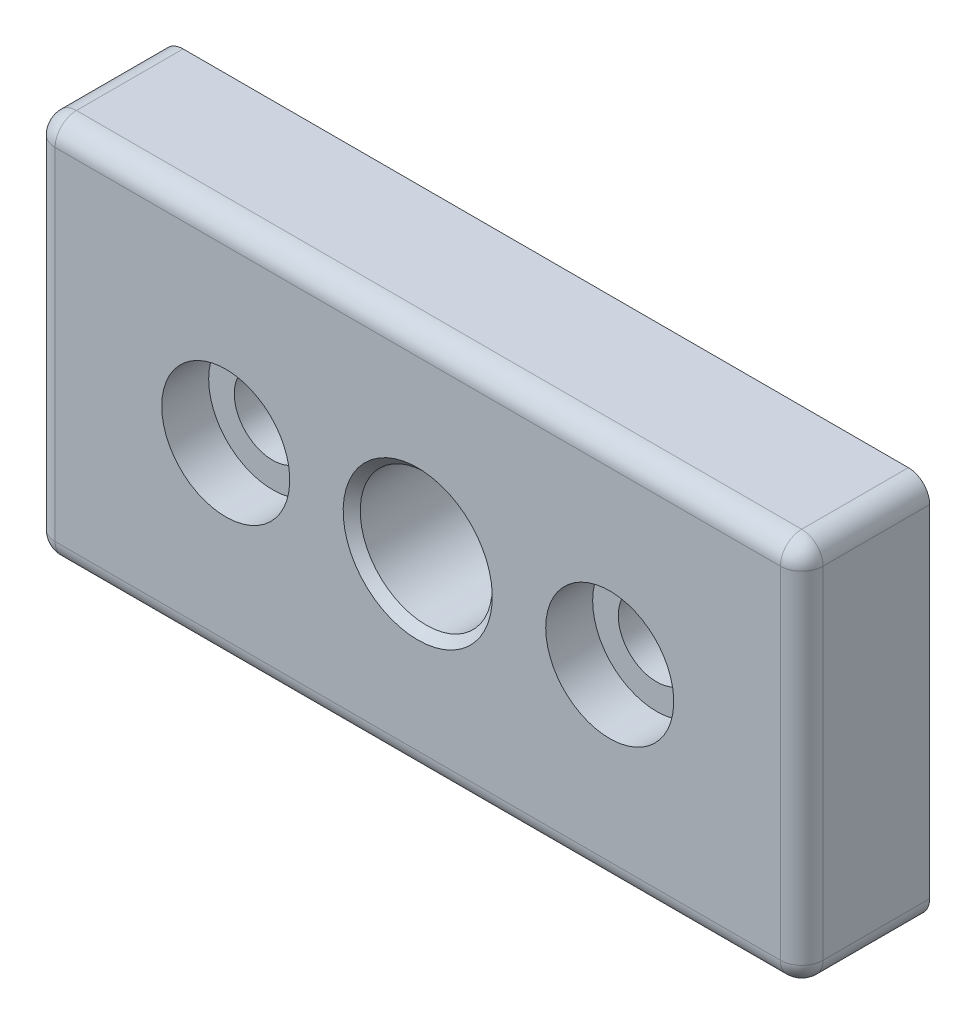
ISO-10303-21;
HEADER;
FILE_DESCRIPTION(('STEP AP214'),'2;1');
FILE_NAME('part.step','',(''),(''),'','','');
FILE_SCHEMA(('AUTOMOTIVE_DESIGN { 1 0 10303 214 1 1 1 1 }'));
ENDSEC;
DATA;
#1=APPLICATION_CONTEXT('core data for automotive mechanical design processes');
#2=APPLICATION_PROTOCOL_DEFINITION('international standard','automotive_design',2000,#1);
#3=PRODUCT_CONTEXT('',#1,'mechanical');
#4=PRODUCT('Part','Part','',(#3));
#5=PRODUCT_RELATED_PRODUCT_CATEGORY('part','',(#4));
#6=PRODUCT_DEFINITION_FORMATION('','',#4);
#7=PRODUCT_DEFINITION_CONTEXT('part definition',#1,'design');
#8=PRODUCT_DEFINITION('design','',#6,#7);
#9=PRODUCT_DEFINITION_SHAPE('','',#8);
#10=(LENGTH_UNIT() NAMED_UNIT(*) SI_UNIT(.MILLI.,.METRE.));
#11=(NAMED_UNIT(*) PLANE_ANGLE_UNIT() SI_UNIT($,.RADIAN.));
#12=(NAMED_UNIT(*) SI_UNIT($,.STERADIAN.) SOLID_ANGLE_UNIT());
#13=UNCERTAINTY_MEASURE_WITH_UNIT(LENGTH_MEASURE(1.E-05),#10,'distance_accuracy_value','');
#14=(GEOMETRIC_REPRESENTATION_CONTEXT(3) GLOBAL_UNCERTAINTY_ASSIGNED_CONTEXT((#13)) GLOBAL_UNIT_ASSIGNED_CONTEXT((#10,
#11,#12)) REPRESENTATION_CONTEXT('',''));
#15=CARTESIAN_POINT('',(0.,0.,0.));
#16=DIRECTION('',(0.,0.,1.));
#17=DIRECTION('',(1.,0.,0.));
#18=AXIS2_PLACEMENT_3D('',#15,#16,#17);
#19=CARTESIAN_POINT('',(0.,0.,15.0000000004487));
#20=DIRECTION('',(0.,0.,1.));
#21=DIRECTION('',(0.,-1.,0.));
#22=AXIS2_PLACEMENT_3D('',#19,#20,#21);
#23=CONICAL_SURFACE('',#22,8.73906249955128,0.7853981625);
#24=CARTESIAN_POINT('',(0.,0.,15.0000000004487));
#25=DIRECTION('',(0.,0.,1.));
#26=DIRECTION('',(0.,-1.,0.));
#27=AXIS2_PLACEMENT_3D('',#24,#25,#26);
#28=CIRCLE('',#27,8.73906249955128);
#29=CARTESIAN_POINT('',(0.,-8.73906249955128,15.0000000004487));
#30=VERTEX_POINT('',#29);
#31=EDGE_CURVE('E19',#30,#30,#28,.F.);
#32=ORIENTED_EDGE('',*,*,#31,.F.);
#33=EDGE_LOOP('',(#32));
#34=FACE_BOUND('',#33,.T.);
#35=CARTESIAN_POINT('',(0.,0.,14.));
#36=DIRECTION('',(0.,0.,1.));
#37=DIRECTION('',(1.,0.,0.));
#38=AXIS2_PLACEMENT_3D('',#35,#36,#37);
#39=CIRCLE('',#38,7.7390625);
#40=CARTESIAN_POINT('',(7.7390625,0.,14.));
#41=VERTEX_POINT('',#40);
#42=EDGE_CURVE('E118',#41,#41,#39,.F.);
#43=ORIENTED_EDGE('',*,*,#42,.T.);
#44=EDGE_LOOP('',(#43));
#45=FACE_BOUND('',#44,.T.);
#46=ADVANCED_FACE('F15',(#34,#45),#23,.F.);
#47=CARTESIAN_POINT('',(0.,0.,15.));
#48=DIRECTION('',(0.,0.,1.));
#49=DIRECTION('',(1.,0.,0.));
#50=AXIS2_PLACEMENT_3D('',#47,#48,#49);
#51=PLANE('',#50);
#52=ORIENTED_EDGE('',*,*,#31,.T.);
#53=EDGE_LOOP('',(#52));
#54=FACE_BOUND('',#53,.T.);
#55=CARTESIAN_POINT('',(-22.5,0.,15.));
#56=DIRECTION('',(0.,0.,-1.));
#57=DIRECTION('',(-1.,0.,0.));
#58=AXIS2_PLACEMENT_3D('',#55,#56,#57);
#59=CIRCLE('',#58,7.5);
#60=CARTESIAN_POINT('',(-30.,0.,15.));
#61=VERTEX_POINT('',#60);
#62=EDGE_CURVE('E116',#61,#61,#59,.T.);
#63=ORIENTED_EDGE('',*,*,#62,.T.);
#64=EDGE_LOOP('',(#63));
#65=FACE_BOUND('',#64,.T.);
#66=CARTESIAN_POINT('',(22.5,0.,15.));
#67=DIRECTION('',(0.,0.,-1.));
#68=DIRECTION('',(-1.,0.,0.));
#69=AXIS2_PLACEMENT_3D('',#66,#67,#68);
#70=CIRCLE('',#69,7.5);
#71=CARTESIAN_POINT('',(15.,0.,15.));
#72=VERTEX_POINT('',#71);
#73=EDGE_CURVE('E113',#72,#72,#70,.T.);
#74=ORIENTED_EDGE('',*,*,#73,.T.);
#75=EDGE_LOOP('',(#74));
#76=FACE_BOUND('',#75,.T.);
#77=DIRECTION('',(-1.,0.,0.));
#78=VECTOR('',#77,1.);
#79=CARTESIAN_POINT('',(22.5,-20.,15.));
#80=LINE('',#79,#78);
#81=CARTESIAN_POINT('',(42.5,-20.0000000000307,15.));
#82=VERTEX_POINT('',#81);
#83=CARTESIAN_POINT('',(-42.5,-20.,15.));
#84=VERTEX_POINT('',#83);
#85=EDGE_CURVE('E139',#82,#84,#80,.T.);
#86=ORIENTED_EDGE('',*,*,#85,.F.);
#87=DIRECTION('',(0.,-1.,0.));
#88=VECTOR('',#87,1.);
#89=CARTESIAN_POINT('',(42.5,11.25,15.));
#90=LINE('',#89,#88);
#91=CARTESIAN_POINT('',(42.5,20.,15.));
#92=VERTEX_POINT('',#91);
#93=EDGE_CURVE('E132',#92,#82,#90,.T.);
#94=ORIENTED_EDGE('',*,*,#93,.F.);
#95=DIRECTION('',(1.,0.,0.));
#96=VECTOR('',#95,1.);
#97=CARTESIAN_POINT('',(-22.5,20.,15.));
#98=LINE('',#97,#96);
#99=CARTESIAN_POINT('',(-42.5,20.0000000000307,15.));
#100=VERTEX_POINT('',#99);
#101=EDGE_CURVE('E115',#100,#92,#98,.T.);
#102=ORIENTED_EDGE('',*,*,#101,.F.);
#103=DIRECTION('',(0.,1.,0.));
#104=VECTOR('',#103,1.);
#105=CARTESIAN_POINT('',(-42.5,-11.25,15.));
#106=LINE('',#105,#104);
#107=EDGE_CURVE('E144',#84,#100,#106,.T.);
#108=ORIENTED_EDGE('',*,*,#107,.F.);
#109=EDGE_LOOP('',(#86,#94,#102,#108));
#110=FACE_BOUND('',#109,.T.);
#111=ADVANCED_FACE('F280',(#54,#65,#76,#110),#51,.T.);
#112=CARTESIAN_POINT('',(0.,0.,0.));
#113=DIRECTION('',(0.,0.,1.));
#114=DIRECTION('',(1.,0.,0.));
#115=AXIS2_PLACEMENT_3D('',#112,#113,#114);
#116=CYLINDRICAL_SURFACE('',#115,7.7390625);
#117=ORIENTED_EDGE('',*,*,#42,.F.);
#118=EDGE_LOOP('',(#117));
#119=FACE_BOUND('',#118,.T.);
#120=CARTESIAN_POINT('',(0.,0.,0.));
#121=DIRECTION('',(0.,0.,1.));
#122=DIRECTION('',(1.,0.,0.));
#123=AXIS2_PLACEMENT_3D('',#120,#121,#122);
#124=CIRCLE('',#123,7.7390625);
#125=CARTESIAN_POINT('',(7.7390625,0.,0.));
#126=VERTEX_POINT('',#125);
#127=EDGE_CURVE('E109',#126,#126,#124,.F.);
#128=ORIENTED_EDGE('',*,*,#127,.T.);
#129=EDGE_LOOP('',(#128));
#130=FACE_BOUND('',#129,.T.);
#131=ADVANCED_FACE('F276',(#119,#130),#116,.F.);
#132=CARTESIAN_POINT('',(-22.5,0.,15.));
#133=DIRECTION('',(0.,0.,-1.));
#134=DIRECTION('',(-1.,0.,0.));
#135=AXIS2_PLACEMENT_3D('',#132,#133,#134);
#136=CYLINDRICAL_SURFACE('',#135,7.5);
#137=CARTESIAN_POINT('',(-22.5,0.,9.5));
#138=DIRECTION('',(0.,0.,-1.));
#139=DIRECTION('',(-1.,0.,0.));
#140=AXIS2_PLACEMENT_3D('',#137,#138,#139);
#141=CIRCLE('',#140,7.5);
#142=CARTESIAN_POINT('',(-30.,0.,9.5));
#143=VERTEX_POINT('',#142);
#144=EDGE_CURVE('E106',#143,#143,#141,.T.);
#145=ORIENTED_EDGE('',*,*,#144,.T.);
#146=EDGE_LOOP('',(#145));
#147=FACE_BOUND('',#146,.T.);
#148=ORIENTED_EDGE('',*,*,#62,.F.);
#149=EDGE_LOOP('',(#148));
#150=FACE_BOUND('',#149,.T.);
#151=ADVANCED_FACE('F279',(#147,#150),#136,.F.);
#152=CARTESIAN_POINT('',(22.5,0.,15.));
#153=DIRECTION('',(0.,0.,-1.));
#154=DIRECTION('',(-1.,0.,0.));
#155=AXIS2_PLACEMENT_3D('',#152,#153,#154);
#156=CYLINDRICAL_SURFACE('',#155,7.5);
#157=CARTESIAN_POINT('',(22.5,0.,9.5));
#158=DIRECTION('',(0.,0.,-1.));
#159=DIRECTION('',(-1.,0.,0.));
#160=AXIS2_PLACEMENT_3D('',#157,#158,#159);
#161=CIRCLE('',#160,7.5);
#162=CARTESIAN_POINT('',(15.,0.,9.5));
#163=VERTEX_POINT('',#162);
#164=EDGE_CURVE('E102',#163,#163,#161,.T.);
#165=ORIENTED_EDGE('',*,*,#164,.T.);
#166=EDGE_LOOP('',(#165));
#167=FACE_BOUND('',#166,.T.);
#168=ORIENTED_EDGE('',*,*,#73,.F.);
#169=EDGE_LOOP('',(#168));
#170=FACE_BOUND('',#169,.T.);
#171=ADVANCED_FACE('F274',(#167,#170),#156,.F.);
#172=CARTESIAN_POINT('',(-22.5,20.,12.5));
#173=DIRECTION('',(1.,0.,0.));
#174=DIRECTION('',(0.,1.,0.));
#175=AXIS2_PLACEMENT_3D('',#172,#173,#174);
#176=CYLINDRICAL_SURFACE('',#175,2.5);
#177=CARTESIAN_POINT('',(-42.5,20.,12.5));
#178=DIRECTION('',(1.,0.,0.));
#179=DIRECTION('',(0.,1.,0.));
#180=AXIS2_PLACEMENT_3D('',#177,#178,#179);
#181=CIRCLE('',#180,2.5);
#182=CARTESIAN_POINT('',(-42.5,22.5,12.5));
#183=VERTEX_POINT('',#182);
#184=EDGE_CURVE('E128',#100,#183,#181,.F.);
#185=ORIENTED_EDGE('',*,*,#184,.F.);
#186=ORIENTED_EDGE('',*,*,#101,.T.);
#187=CARTESIAN_POINT('',(42.5,20.,12.5));
#188=DIRECTION('',(1.,0.,0.));
#189=DIRECTION('',(0.,1.,0.));
#190=AXIS2_PLACEMENT_3D('',#187,#188,#189);
#191=CIRCLE('',#190,2.5);
#192=CARTESIAN_POINT('',(42.5,22.5,12.5));
#193=VERTEX_POINT('',#192);
#194=EDGE_CURVE('E135',#193,#92,#191,.T.);
#195=ORIENTED_EDGE('',*,*,#194,.F.);
#196=DIRECTION('',(1.,0.,0.));
#197=VECTOR('',#196,1.);
#198=CARTESIAN_POINT('',(-45.,22.5,12.5));
#199=LINE('',#198,#197);
#200=EDGE_CURVE('E105',#183,#193,#199,.T.);
#201=ORIENTED_EDGE('',*,*,#200,.F.);
#202=EDGE_LOOP('',(#185,#186,#195,#201));
#203=FACE_BOUND('',#202,.T.);
#204=ADVANCED_FACE('F270',(#203),#176,.T.);
#205=CARTESIAN_POINT('',(-42.5,20.,12.5));
#206=DIRECTION('',(1.,0.,0.));
#207=DIRECTION('',(0.,1.,0.));
#208=AXIS2_PLACEMENT_3D('',#205,#206,#207);
#209=SPHERICAL_SURFACE('',#208,2.5);
#210=ORIENTED_EDGE('',*,*,#184,.T.);
#211=CARTESIAN_POINT('',(-42.5,20.,12.5));
#212=DIRECTION('',(0.,0.,1.));
#213=DIRECTION('',(1.,0.,0.));
#214=AXIS2_PLACEMENT_3D('',#211,#212,#213);
#215=CIRCLE('',#214,2.5);
#216=CARTESIAN_POINT('',(-45.,20.,12.5));
#217=VERTEX_POINT('',#216);
#218=EDGE_CURVE('E228',#217,#183,#215,.F.);
#219=ORIENTED_EDGE('',*,*,#218,.F.);
#220=CARTESIAN_POINT('',(-42.5,20.,12.5));
#221=DIRECTION('',(0.,1.,0.));
#222=DIRECTION('',(-1.,0.,0.));
#223=AXIS2_PLACEMENT_3D('',#220,#221,#222);
#224=CIRCLE('',#223,2.5);
#225=EDGE_CURVE('E147',#100,#217,#224,.F.);
#226=ORIENTED_EDGE('',*,*,#225,.F.);
#227=EDGE_LOOP('',(#210,#219,#226));
#228=FACE_BOUND('',#227,.T.);
#229=ADVANCED_FACE('F267',(#228),#209,.T.);
#230=CARTESIAN_POINT('',(-42.5,-11.25,12.5));
#231=DIRECTION('',(0.,1.,0.));
#232=DIRECTION('',(-1.,0.,0.));
#233=AXIS2_PLACEMENT_3D('',#230,#231,#232);
#234=CYLINDRICAL_SURFACE('',#233,2.5);
#235=CARTESIAN_POINT('',(-42.5,-20.,12.5));
#236=DIRECTION('',(0.,-1.,0.));
#237=DIRECTION('',(1.,0.,0.));
#238=AXIS2_PLACEMENT_3D('',#235,#236,#237);
#239=CIRCLE('',#238,2.5);
#240=CARTESIAN_POINT('',(-45.,-20.,12.5));
#241=VERTEX_POINT('',#240);
#242=EDGE_CURVE('E146',#84,#241,#239,.T.);
#243=ORIENTED_EDGE('',*,*,#242,.F.);
#244=ORIENTED_EDGE('',*,*,#107,.T.);
#245=ORIENTED_EDGE('',*,*,#225,.T.);
#246=DIRECTION('',(0.,1.,0.));
#247=VECTOR('',#246,1.);
#248=CARTESIAN_POINT('',(-45.,-22.5,12.5));
#249=LINE('',#248,#247);
#250=EDGE_CURVE('E74',#241,#217,#249,.T.);
#251=ORIENTED_EDGE('',*,*,#250,.F.);
#252=EDGE_LOOP('',(#243,#244,#245,#251));
#253=FACE_BOUND('',#252,.T.);
#254=ADVANCED_FACE('F255',(#253),#234,.T.);
#255=CARTESIAN_POINT('',(-42.5,-20.,12.5));
#256=DIRECTION('',(1.,0.,0.));
#257=DIRECTION('',(0.,1.,0.));
#258=AXIS2_PLACEMENT_3D('',#255,#256,#257);
#259=SPHERICAL_SURFACE('',#258,2.5);
#260=ORIENTED_EDGE('',*,*,#242,.T.);
#261=CARTESIAN_POINT('',(-42.5,-20.,12.5));
#262=DIRECTION('',(0.,0.,1.));
#263=DIRECTION('',(1.,0.,0.));
#264=AXIS2_PLACEMENT_3D('',#261,#262,#263);
#265=CIRCLE('',#264,2.5);
#266=CARTESIAN_POINT('',(-42.5,-22.5,12.5));
#267=VERTEX_POINT('',#266);
#268=EDGE_CURVE('E456',#267,#241,#265,.F.);
#269=ORIENTED_EDGE('',*,*,#268,.F.);
#270=CARTESIAN_POINT('',(-42.5,-20.,12.5));
#271=DIRECTION('',(-1.,0.,0.));
#272=DIRECTION('',(0.,0.,1.));
#273=AXIS2_PLACEMENT_3D('',#270,#271,#272);
#274=CIRCLE('',#273,2.5);
#275=EDGE_CURVE('E143',#84,#267,#274,.F.);
#276=ORIENTED_EDGE('',*,*,#275,.F.);
#277=EDGE_LOOP('',(#260,#269,#276));
#278=FACE_BOUND('',#277,.T.);
#279=ADVANCED_FACE('F250',(#278),#259,.T.);
#280=CARTESIAN_POINT('',(22.5,-20.,12.5));
#281=DIRECTION('',(-1.,0.,0.));
#282=DIRECTION('',(0.,0.,1.));
#283=AXIS2_PLACEMENT_3D('',#280,#281,#282);
#284=CYLINDRICAL_SURFACE('',#283,2.5);
#285=CARTESIAN_POINT('',(42.5,-20.,12.5));
#286=DIRECTION('',(1.,0.,0.));
#287=DIRECTION('',(0.,1.,0.));
#288=AXIS2_PLACEMENT_3D('',#285,#286,#287);
#289=CIRCLE('',#288,2.5);
#290=CARTESIAN_POINT('',(42.5,-22.5,12.5));
#291=VERTEX_POINT('',#290);
#292=EDGE_CURVE('E142',#82,#291,#289,.T.);
#293=ORIENTED_EDGE('',*,*,#292,.F.);
#294=ORIENTED_EDGE('',*,*,#85,.T.);
#295=ORIENTED_EDGE('',*,*,#275,.T.);
#296=DIRECTION('',(1.,0.,0.));
#297=VECTOR('',#296,1.);
#298=CARTESIAN_POINT('',(45.,-22.5,12.5));
#299=LINE('',#298,#297);
#300=EDGE_CURVE('E236',#291,#267,#299,.F.);
#301=ORIENTED_EDGE('',*,*,#300,.F.);
#302=EDGE_LOOP('',(#293,#294,#295,#301));
#303=FACE_BOUND('',#302,.T.);
#304=ADVANCED_FACE('F246',(#303),#284,.T.);
#305=CARTESIAN_POINT('',(42.5,-20.,12.5));
#306=DIRECTION('',(1.,0.,0.));
#307=DIRECTION('',(0.,1.,0.));
#308=AXIS2_PLACEMENT_3D('',#305,#306,#307);
#309=SPHERICAL_SURFACE('',#308,2.5);
#310=CARTESIAN_POINT('',(42.5,-20.,12.5));
#311=DIRECTION('',(0.,-1.,0.));
#312=DIRECTION('',(1.,0.,0.));
#313=AXIS2_PLACEMENT_3D('',#310,#311,#312);
#314=CIRCLE('',#313,2.5);
#315=CARTESIAN_POINT('',(45.,-20.,12.5));
#316=VERTEX_POINT('',#315);
#317=EDGE_CURVE('E136',#82,#316,#314,.F.);
#318=ORIENTED_EDGE('',*,*,#317,.F.);
#319=ORIENTED_EDGE('',*,*,#292,.T.);
#320=CARTESIAN_POINT('',(42.5,-20.,12.5));
#321=DIRECTION('',(0.,0.,1.));
#322=DIRECTION('',(1.,0.,0.));
#323=AXIS2_PLACEMENT_3D('',#320,#321,#322);
#324=CIRCLE('',#323,2.5);
#325=EDGE_CURVE('E229',#316,#291,#324,.F.);
#326=ORIENTED_EDGE('',*,*,#325,.F.);
#327=EDGE_LOOP('',(#318,#319,#326));
#328=FACE_BOUND('',#327,.T.);
#329=ADVANCED_FACE('F243',(#328),#309,.T.);
#330=CARTESIAN_POINT('',(42.5,11.25,12.5));
#331=DIRECTION('',(0.,-1.,0.));
#332=DIRECTION('',(1.,0.,0.));
#333=AXIS2_PLACEMENT_3D('',#330,#331,#332);
#334=CYLINDRICAL_SURFACE('',#333,2.5);
#335=CARTESIAN_POINT('',(42.5,20.,12.5));
#336=DIRECTION('',(0.,-1.,0.));
#337=DIRECTION('',(1.,0.,0.));
#338=AXIS2_PLACEMENT_3D('',#335,#336,#337);
#339=CIRCLE('',#338,2.5);
#340=CARTESIAN_POINT('',(45.,20.,12.5));
#341=VERTEX_POINT('',#340);
#342=EDGE_CURVE('E112',#92,#341,#339,.F.);
#343=ORIENTED_EDGE('',*,*,#342,.F.);
#344=ORIENTED_EDGE('',*,*,#93,.T.);
#345=ORIENTED_EDGE('',*,*,#317,.T.);
#346=DIRECTION('',(0.,1.,0.));
#347=VECTOR('',#346,1.);
#348=CARTESIAN_POINT('',(45.,22.5,12.5));
#349=LINE('',#348,#347);
#350=EDGE_CURVE('E462',#341,#316,#349,.F.);
#351=ORIENTED_EDGE('',*,*,#350,.F.);
#352=EDGE_LOOP('',(#343,#344,#345,#351));
#353=FACE_BOUND('',#352,.T.);
#354=ADVANCED_FACE('F214',(#353),#334,.T.);
#355=CARTESIAN_POINT('',(42.5,20.,12.5));
#356=DIRECTION('',(1.,0.,0.));
#357=DIRECTION('',(0.,1.,0.));
#358=AXIS2_PLACEMENT_3D('',#355,#356,#357);
#359=SPHERICAL_SURFACE('',#358,2.5);
#360=ORIENTED_EDGE('',*,*,#194,.T.);
#361=ORIENTED_EDGE('',*,*,#342,.T.);
#362=CARTESIAN_POINT('',(42.5,20.,12.5));
#363=DIRECTION('',(0.,0.,1.));
#364=DIRECTION('',(1.,0.,0.));
#365=AXIS2_PLACEMENT_3D('',#362,#363,#364);
#366=CIRCLE('',#365,2.5);
#367=EDGE_CURVE('E220',#193,#341,#366,.F.);
#368=ORIENTED_EDGE('',*,*,#367,.F.);
#369=EDGE_LOOP('',(#360,#361,#368));
#370=FACE_BOUND('',#369,.T.);
#371=ADVANCED_FACE('F209',(#370),#359,.T.);
#372=CARTESIAN_POINT('',(0.,0.,0.));
#373=DIRECTION('',(0.,0.,1.));
#374=DIRECTION('',(1.,0.,0.));
#375=AXIS2_PLACEMENT_3D('',#372,#373,#374);
#376=PLANE('',#375);
#377=ORIENTED_EDGE('',*,*,#127,.F.);
#378=EDGE_LOOP('',(#377));
#379=FACE_BOUND('',#378,.T.);
#380=CARTESIAN_POINT('',(0.,0.,0.));
#381=DIRECTION('',(0.,0.,-1.));
#382=DIRECTION('',(-1.,0.,0.));
#383=AXIS2_PLACEMENT_3D('',#380,#381,#382);
#384=CIRCLE('',#383,8.3);
#385=CARTESIAN_POINT('',(-8.3,0.,0.));
#386=VERTEX_POINT('',#385);
#387=EDGE_CURVE('E99',#386,#386,#384,.T.);
#388=ORIENTED_EDGE('',*,*,#387,.T.);
#389=EDGE_LOOP('',(#388));
#390=FACE_BOUND('',#389,.T.);
#391=ADVANCED_FACE('F205',(#379,#390),#376,.F.);
#392=CARTESIAN_POINT('',(-30.15,7.65,9.5));
#393=DIRECTION('',(0.,0.,-1.));
#394=DIRECTION('',(1.,0.,0.));
#395=AXIS2_PLACEMENT_3D('',#392,#393,#394);
#396=PLANE('',#395);
#397=CARTESIAN_POINT('',(-22.5,0.,9.5));
#398=DIRECTION('',(0.,0.,1.));
#399=DIRECTION('',(1.,0.,0.));
#400=AXIS2_PLACEMENT_3D('',#397,#398,#399);
#401=CIRCLE('',#400,4.5);
#402=CARTESIAN_POINT('',(-18.,0.,9.5));
#403=VERTEX_POINT('',#402);
#404=EDGE_CURVE('E96',#403,#403,#401,.F.);
#405=ORIENTED_EDGE('',*,*,#404,.T.);
#406=EDGE_LOOP('',(#405));
#407=FACE_BOUND('',#406,.T.);
#408=ORIENTED_EDGE('',*,*,#144,.F.);
#409=EDGE_LOOP('',(#408));
#410=FACE_BOUND('',#409,.T.);
#411=ADVANCED_FACE('F208',(#407,#410),#396,.F.);
#412=CARTESIAN_POINT('',(14.85,7.65,9.5));
#413=DIRECTION('',(0.,0.,-1.));
#414=DIRECTION('',(1.,0.,0.));
#415=AXIS2_PLACEMENT_3D('',#412,#413,#414);
#416=PLANE('',#415);
#417=CARTESIAN_POINT('',(22.5,0.,9.5));
#418=DIRECTION('',(0.,0.,1.));
#419=DIRECTION('',(1.,0.,0.));
#420=AXIS2_PLACEMENT_3D('',#417,#418,#419);
#421=CIRCLE('',#420,4.5);
#422=CARTESIAN_POINT('',(27.,0.,9.5));
#423=VERTEX_POINT('',#422);
#424=EDGE_CURVE('E89',#423,#423,#421,.F.);
#425=ORIENTED_EDGE('',*,*,#424,.T.);
#426=EDGE_LOOP('',(#425));
#427=FACE_BOUND('',#426,.T.);
#428=ORIENTED_EDGE('',*,*,#164,.F.);
#429=EDGE_LOOP('',(#428));
#430=FACE_BOUND('',#429,.T.);
#431=ADVANCED_FACE('F17',(#427,#430),#416,.F.);
#432=CARTESIAN_POINT('',(-45.,22.5,0.));
#433=DIRECTION('',(0.,1.,0.));
#434=DIRECTION('',(0.,0.,1.));
#435=AXIS2_PLACEMENT_3D('',#432,#433,#434);
#436=PLANE('',#435);
#437=DIRECTION('',(0.,0.,1.));
#438=VECTOR('',#437,1.);
#439=CARTESIAN_POINT('',(-42.5,22.5,0.));
#440=LINE('',#439,#438);
#441=CARTESIAN_POINT('',(-42.5,22.5,0.));
#442=VERTEX_POINT('',#441);
#443=EDGE_CURVE('E60',#183,#442,#440,.F.);
#444=ORIENTED_EDGE('',*,*,#443,.F.);
#445=ORIENTED_EDGE('',*,*,#200,.T.);
#446=DIRECTION('',(0.,0.,1.));
#447=VECTOR('',#446,1.);
#448=CARTESIAN_POINT('',(42.5,22.5,0.));
#449=LINE('',#448,#447);
#450=CARTESIAN_POINT('',(42.5,22.5,0.));
#451=VERTEX_POINT('',#450);
#452=EDGE_CURVE('E468',#451,#193,#449,.T.);
#453=ORIENTED_EDGE('',*,*,#452,.F.);
#454=DIRECTION('',(1.,0.,0.));
#455=VECTOR('',#454,1.);
#456=CARTESIAN_POINT('',(0.,22.5,0.));
#457=LINE('',#456,#455);
#458=EDGE_CURVE('E87',#451,#442,#457,.F.);
#459=ORIENTED_EDGE('',*,*,#458,.T.);
#460=EDGE_LOOP('',(#444,#445,#453,#459));
#461=FACE_BOUND('',#460,.T.);
#462=ADVANCED_FACE('F201',(#461),#436,.T.);
#463=CARTESIAN_POINT('',(-42.5,20.,0.));
#464=DIRECTION('',(0.,0.,1.));
#465=DIRECTION('',(1.,0.,0.));
#466=AXIS2_PLACEMENT_3D('',#463,#464,#465);
#467=CYLINDRICAL_SURFACE('',#466,2.5);
#468=ORIENTED_EDGE('',*,*,#218,.T.);
#469=ORIENTED_EDGE('',*,*,#443,.T.);
#470=CARTESIAN_POINT('',(-42.5,20.,0.));
#471=DIRECTION('',(0.,0.,1.));
#472=DIRECTION('',(1.,0.,0.));
#473=AXIS2_PLACEMENT_3D('',#470,#471,#472);
#474=CIRCLE('',#473,2.5);
#475=CARTESIAN_POINT('',(-45.,20.,0.));
#476=VERTEX_POINT('',#475);
#477=EDGE_CURVE('E80',#442,#476,#474,.T.);
#478=ORIENTED_EDGE('',*,*,#477,.T.);
#479=DIRECTION('',(0.,0.,1.));
#480=VECTOR('',#479,1.);
#481=CARTESIAN_POINT('',(-45.,20.,0.));
#482=LINE('',#481,#480);
#483=EDGE_CURVE('E67',#217,#476,#482,.F.);
#484=ORIENTED_EDGE('',*,*,#483,.F.);
#485=EDGE_LOOP('',(#468,#469,#478,#484));
#486=FACE_BOUND('',#485,.T.);
#487=ADVANCED_FACE('F86',(#486),#467,.T.);
#488=CARTESIAN_POINT('',(-45.,-22.5,0.));
#489=DIRECTION('',(-1.,0.,0.));
#490=DIRECTION('',(0.,0.,1.));
#491=AXIS2_PLACEMENT_3D('',#488,#489,#490);
#492=PLANE('',#491);
#493=DIRECTION('',(0.,0.,1.));
#494=VECTOR('',#493,1.);
#495=CARTESIAN_POINT('',(-45.,-20.,0.));
#496=LINE('',#495,#494);
#497=CARTESIAN_POINT('',(-45.,-20.,0.));
#498=VERTEX_POINT('',#497);
#499=EDGE_CURVE('E239',#241,#498,#496,.F.);
#500=ORIENTED_EDGE('',*,*,#499,.F.);
#501=ORIENTED_EDGE('',*,*,#250,.T.);
#502=ORIENTED_EDGE('',*,*,#483,.T.);
#503=DIRECTION('',(0.,1.,0.));
#504=VECTOR('',#503,1.);
#505=CARTESIAN_POINT('',(-45.,0.,0.));
#506=LINE('',#505,#504);
#507=EDGE_CURVE('E71',#476,#498,#506,.F.);
#508=ORIENTED_EDGE('',*,*,#507,.T.);
#509=EDGE_LOOP('',(#500,#501,#502,#508));
#510=FACE_BOUND('',#509,.T.);
#511=ADVANCED_FACE('F70',(#510),#492,.T.);
#512=CARTESIAN_POINT('',(-42.5,-20.,0.));
#513=DIRECTION('',(0.,0.,1.));
#514=DIRECTION('',(1.,0.,0.));
#515=AXIS2_PLACEMENT_3D('',#512,#513,#514);
#516=CYLINDRICAL_SURFACE('',#515,2.5);
#517=ORIENTED_EDGE('',*,*,#268,.T.);
#518=ORIENTED_EDGE('',*,*,#499,.T.);
#519=CARTESIAN_POINT('',(-42.5,-20.,0.));
#520=DIRECTION('',(0.,0.,1.));
#521=DIRECTION('',(1.,0.,0.));
#522=AXIS2_PLACEMENT_3D('',#519,#520,#521);
#523=CIRCLE('',#522,2.5);
#524=CARTESIAN_POINT('',(-42.5,-22.5,0.));
#525=VERTEX_POINT('',#524);
#526=EDGE_CURVE('E84',#498,#525,#523,.T.);
#527=ORIENTED_EDGE('',*,*,#526,.T.);
#528=DIRECTION('',(0.,0.,-1.));
#529=VECTOR('',#528,1.);
#530=CARTESIAN_POINT('',(-42.5,-22.5,0.));
#531=LINE('',#530,#529);
#532=EDGE_CURVE('E233',#267,#525,#531,.T.);
#533=ORIENTED_EDGE('',*,*,#532,.F.);
#534=EDGE_LOOP('',(#517,#518,#527,#533));
#535=FACE_BOUND('',#534,.T.);
#536=ADVANCED_FACE('F193',(#535),#516,.T.);
#537=CARTESIAN_POINT('',(45.,-22.5,0.));
#538=DIRECTION('',(0.,-1.,0.));
#539=DIRECTION('',(0.,0.,-1.));
#540=AXIS2_PLACEMENT_3D('',#537,#538,#539);
#541=PLANE('',#540);
#542=ORIENTED_EDGE('',*,*,#532,.T.);
#543=DIRECTION('',(1.,0.,0.));
#544=VECTOR('',#543,1.);
#545=CARTESIAN_POINT('',(0.,-22.5,0.));
#546=LINE('',#545,#544);
#547=CARTESIAN_POINT('',(42.5,-22.5,0.));
#548=VERTEX_POINT('',#547);
#549=EDGE_CURVE('E158',#525,#548,#546,.T.);
#550=ORIENTED_EDGE('',*,*,#549,.T.);
#551=DIRECTION('',(0.,0.,1.));
#552=VECTOR('',#551,1.);
#553=CARTESIAN_POINT('',(42.5,-22.5,0.));
#554=LINE('',#553,#552);
#555=EDGE_CURVE('E232',#291,#548,#554,.F.);
#556=ORIENTED_EDGE('',*,*,#555,.F.);
#557=ORIENTED_EDGE('',*,*,#300,.T.);
#558=EDGE_LOOP('',(#542,#550,#556,#557));
#559=FACE_BOUND('',#558,.T.);
#560=ADVANCED_FACE('F190',(#559),#541,.T.);
#561=CARTESIAN_POINT('',(42.5,-20.,0.));
#562=DIRECTION('',(0.,0.,1.));
#563=DIRECTION('',(1.,0.,0.));
#564=AXIS2_PLACEMENT_3D('',#561,#562,#563);
#565=CYLINDRICAL_SURFACE('',#564,2.5);
#566=ORIENTED_EDGE('',*,*,#325,.T.);
#567=ORIENTED_EDGE('',*,*,#555,.T.);
#568=CARTESIAN_POINT('',(42.5,-20.,0.));
#569=DIRECTION('',(0.,0.,1.));
#570=DIRECTION('',(1.,0.,0.));
#571=AXIS2_PLACEMENT_3D('',#568,#569,#570);
#572=CIRCLE('',#571,2.5);
#573=CARTESIAN_POINT('',(45.,-20.,0.));
#574=VERTEX_POINT('',#573);
#575=EDGE_CURVE('E156',#548,#574,#572,.T.);
#576=ORIENTED_EDGE('',*,*,#575,.T.);
#577=DIRECTION('',(0.,0.,-1.));
#578=VECTOR('',#577,1.);
#579=CARTESIAN_POINT('',(45.,-20.,0.));
#580=LINE('',#579,#578);
#581=EDGE_CURVE('E464',#316,#574,#580,.T.);
#582=ORIENTED_EDGE('',*,*,#581,.F.);
#583=EDGE_LOOP('',(#566,#567,#576,#582));
#584=FACE_BOUND('',#583,.T.);
#585=ADVANCED_FACE('F186',(#584),#565,.T.);
#586=CARTESIAN_POINT('',(45.,22.5,0.));
#587=DIRECTION('',(1.,0.,0.));
#588=DIRECTION('',(0.,0.,-1.));
#589=AXIS2_PLACEMENT_3D('',#586,#587,#588);
#590=PLANE('',#589);
#591=ORIENTED_EDGE('',*,*,#581,.T.);
#592=DIRECTION('',(0.,1.,0.));
#593=VECTOR('',#592,1.);
#594=CARTESIAN_POINT('',(45.,0.,0.));
#595=LINE('',#594,#593);
#596=CARTESIAN_POINT('',(45.,20.,0.));
#597=VERTEX_POINT('',#596);
#598=EDGE_CURVE('E155',#574,#597,#595,.T.);
#599=ORIENTED_EDGE('',*,*,#598,.T.);
#600=DIRECTION('',(0.,0.,1.));
#601=VECTOR('',#600,1.);
#602=CARTESIAN_POINT('',(45.,20.,0.));
#603=LINE('',#602,#601);
#604=EDGE_CURVE('E34',#341,#597,#603,.F.);
#605=ORIENTED_EDGE('',*,*,#604,.F.);
#606=ORIENTED_EDGE('',*,*,#350,.T.);
#607=EDGE_LOOP('',(#591,#599,#605,#606));
#608=FACE_BOUND('',#607,.T.);
#609=ADVANCED_FACE('F183',(#608),#590,.T.);
#610=CARTESIAN_POINT('',(42.5,20.,0.));
#611=DIRECTION('',(0.,0.,1.));
#612=DIRECTION('',(1.,0.,0.));
#613=AXIS2_PLACEMENT_3D('',#610,#611,#612);
#614=CYLINDRICAL_SURFACE('',#613,2.5);
#615=ORIENTED_EDGE('',*,*,#367,.T.);
#616=ORIENTED_EDGE('',*,*,#604,.T.);
#617=CARTESIAN_POINT('',(42.5,20.,0.));
#618=DIRECTION('',(0.,0.,1.));
#619=DIRECTION('',(1.,0.,0.));
#620=AXIS2_PLACEMENT_3D('',#617,#618,#619);
#621=CIRCLE('',#620,2.5);
#622=EDGE_CURVE('E154',#597,#451,#621,.T.);
#623=ORIENTED_EDGE('',*,*,#622,.T.);
#624=ORIENTED_EDGE('',*,*,#452,.T.);
#625=EDGE_LOOP('',(#615,#616,#623,#624));
#626=FACE_BOUND('',#625,.T.);
#627=ADVANCED_FACE('F178',(#626),#614,.T.);
#628=CARTESIAN_POINT('',(0.,0.,0.));
#629=DIRECTION('',(0.,0.,-1.));
#630=DIRECTION('',(-1.,0.,0.));
#631=AXIS2_PLACEMENT_3D('',#628,#629,#630);
#632=TOROIDAL_SURFACE('',#631,9.5,1.2);
#633=CARTESIAN_POINT('',(0.,0.,0.));
#634=DIRECTION('',(0.,0.,-1.));
#635=DIRECTION('',(-1.,0.,0.));
#636=AXIS2_PLACEMENT_3D('',#633,#634,#635);
#637=CIRCLE('',#636,10.7);
#638=CARTESIAN_POINT('',(-10.7,0.,0.));
#639=VERTEX_POINT('',#638);
#640=EDGE_CURVE('E151',#639,#639,#637,.T.);
#641=ORIENTED_EDGE('',*,*,#640,.T.);
#642=EDGE_LOOP('',(#641));
#643=FACE_BOUND('',#642,.T.);
#644=ORIENTED_EDGE('',*,*,#387,.F.);
#645=EDGE_LOOP('',(#644));
#646=FACE_BOUND('',#645,.T.);
#647=ADVANCED_FACE('F173',(#643,#646),#632,.F.);
#648=CARTESIAN_POINT('',(-22.5,0.,0.));
#649=DIRECTION('',(0.,0.,1.));
#650=DIRECTION('',(1.,0.,0.));
#651=AXIS2_PLACEMENT_3D('',#648,#649,#650);
#652=CYLINDRICAL_SURFACE('',#651,4.5);
#653=CARTESIAN_POINT('',(-22.5,0.,0.));
#654=DIRECTION('',(0.,0.,1.));
#655=DIRECTION('',(1.,0.,0.));
#656=AXIS2_PLACEMENT_3D('',#653,#654,#655);
#657=CIRCLE('',#656,4.5);
#658=CARTESIAN_POINT('',(-18.,0.,0.));
#659=VERTEX_POINT('',#658);
#660=EDGE_CURVE('E25',#659,#659,#657,.F.);
#661=ORIENTED_EDGE('',*,*,#660,.T.);
#662=EDGE_LOOP('',(#661));
#663=FACE_BOUND('',#662,.T.);
#664=ORIENTED_EDGE('',*,*,#404,.F.);
#665=EDGE_LOOP('',(#664));
#666=FACE_BOUND('',#665,.T.);
#667=ADVANCED_FACE('F177',(#663,#666),#652,.F.);
#668=CARTESIAN_POINT('',(22.5,0.,0.));
#669=DIRECTION('',(0.,0.,1.));
#670=DIRECTION('',(1.,0.,0.));
#671=AXIS2_PLACEMENT_3D('',#668,#669,#670);
#672=CYLINDRICAL_SURFACE('',#671,4.5);
#673=CARTESIAN_POINT('',(22.5,0.,0.));
#674=DIRECTION('',(0.,0.,1.));
#675=DIRECTION('',(1.,0.,0.));
#676=AXIS2_PLACEMENT_3D('',#673,#674,#675);
#677=CIRCLE('',#676,4.5);
#678=CARTESIAN_POINT('',(27.,0.,0.));
#679=VERTEX_POINT('',#678);
#680=EDGE_CURVE('E10',#679,#679,#677,.F.);
#681=ORIENTED_EDGE('',*,*,#680,.T.);
#682=EDGE_LOOP('',(#681));
#683=FACE_BOUND('',#682,.T.);
#684=ORIENTED_EDGE('',*,*,#424,.F.);
#685=EDGE_LOOP('',(#684));
#686=FACE_BOUND('',#685,.T.);
#687=ADVANCED_FACE('F302',(#683,#686),#672,.F.);
#688=CARTESIAN_POINT('',(0.,0.,0.));
#689=DIRECTION('',(0.,0.,1.));
#690=DIRECTION('',(1.,0.,0.));
#691=AXIS2_PLACEMENT_3D('',#688,#689,#690);
#692=PLANE('',#691);
#693=ORIENTED_EDGE('',*,*,#680,.F.);
#694=EDGE_LOOP('',(#693));
#695=FACE_BOUND('',#694,.T.);
#696=ORIENTED_EDGE('',*,*,#660,.F.);
#697=EDGE_LOOP('',(#696));
#698=FACE_BOUND('',#697,.T.);
#699=ORIENTED_EDGE('',*,*,#640,.F.);
#700=EDGE_LOOP('',(#699));
#701=FACE_BOUND('',#700,.T.);
#702=ORIENTED_EDGE('',*,*,#598,.F.);
#703=ORIENTED_EDGE('',*,*,#575,.F.);
#704=ORIENTED_EDGE('',*,*,#549,.F.);
#705=ORIENTED_EDGE('',*,*,#526,.F.);
#706=ORIENTED_EDGE('',*,*,#507,.F.);
#707=ORIENTED_EDGE('',*,*,#477,.F.);
#708=ORIENTED_EDGE('',*,*,#458,.F.);
#709=ORIENTED_EDGE('',*,*,#622,.F.);
#710=EDGE_LOOP('',(#702,#703,#704,#705,#706,#707,#708,#709));
#711=FACE_BOUND('',#710,.T.);
#712=ADVANCED_FACE('F79',(#695,#698,#701,#711),#692,.F.);
#713=CLOSED_SHELL('',(#46,#111,#131,#151,#171,#204,#229,#254,#279,#304,#329,#354,#371,#391,#411,
#431,#462,#487,#511,#536,#560,#585,#609,#627,#647,#667,#687,#712));
#714=MANIFOLD_SOLID_BREP('B1',#713);
#715=ADVANCED_BREP_SHAPE_REPRESENTATION('',(#18,#714),#14);
#716=SHAPE_DEFINITION_REPRESENTATION(#9,#715);
ENDSEC;
END-ISO-10303-21;
